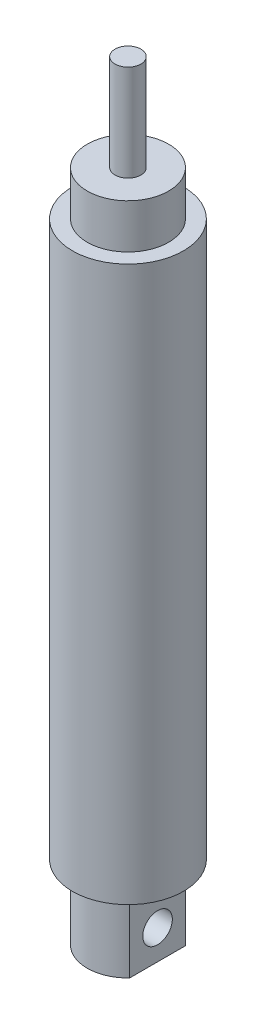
ISO-10303-21;
HEADER;
FILE_DESCRIPTION(('STEP AP214'),'2;1');
FILE_NAME('part.step','',(''),(''),'','','');
FILE_SCHEMA(('AUTOMOTIVE_DESIGN { 1 0 10303 214 1 1 1 1 }'));
ENDSEC;
DATA;
#1=APPLICATION_CONTEXT('core data for automotive mechanical design processes');
#2=APPLICATION_PROTOCOL_DEFINITION('international standard','automotive_design',2000,#1);
#3=PRODUCT_CONTEXT('',#1,'mechanical');
#4=PRODUCT('Part','Part','',(#3));
#5=PRODUCT_RELATED_PRODUCT_CATEGORY('part','',(#4));
#6=PRODUCT_DEFINITION_FORMATION('','',#4);
#7=PRODUCT_DEFINITION_CONTEXT('part definition',#1,'design');
#8=PRODUCT_DEFINITION('design','',#6,#7);
#9=PRODUCT_DEFINITION_SHAPE('','',#8);
#10=(LENGTH_UNIT() NAMED_UNIT(*) SI_UNIT(.MILLI.,.METRE.));
#11=(NAMED_UNIT(*) PLANE_ANGLE_UNIT() SI_UNIT($,.RADIAN.));
#12=(NAMED_UNIT(*) SI_UNIT($,.STERADIAN.) SOLID_ANGLE_UNIT());
#13=UNCERTAINTY_MEASURE_WITH_UNIT(LENGTH_MEASURE(1.E-05),#10,'distance_accuracy_value','');
#14=(GEOMETRIC_REPRESENTATION_CONTEXT(3) GLOBAL_UNCERTAINTY_ASSIGNED_CONTEXT((#13)) GLOBAL_UNIT_ASSIGNED_CONTEXT((#10,
#11,#12)) REPRESENTATION_CONTEXT('',''));
#15=CARTESIAN_POINT('',(0.,0.,0.));
#16=DIRECTION('',(0.,0.,1.));
#17=DIRECTION('',(1.,0.,0.));
#18=AXIS2_PLACEMENT_3D('',#15,#16,#17);
#19=CARTESIAN_POINT('',(0.,20.,0.));
#20=DIRECTION('',(0.,-1.,0.));
#21=DIRECTION('',(0.,0.,-1.));
#22=AXIS2_PLACEMENT_3D('',#19,#20,#21);
#23=CYLINDRICAL_SURFACE('',#22,11.);
#24=CARTESIAN_POINT('',(0.,0.,0.));
#25=DIRECTION('',(0.,1.,0.));
#26=DIRECTION('',(0.,0.,1.));
#27=AXIS2_PLACEMENT_3D('',#24,#25,#26);
#28=CIRCLE('',#27,11.);
#29=CARTESIAN_POINT('',(8.,0.,-7.54983443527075));
#30=VERTEX_POINT('',#29);
#31=CARTESIAN_POINT('',(-8.,0.,-7.54983443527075));
#32=VERTEX_POINT('',#31);
#33=EDGE_CURVE('E101',#30,#32,#28,.T.);
#34=ORIENTED_EDGE('',*,*,#33,.T.);
#35=DIRECTION('',(0.,-1.,0.));
#36=VECTOR('',#35,1.);
#37=CARTESIAN_POINT('',(-8.,20.,-7.54983443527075));
#38=LINE('',#37,#36);
#39=CARTESIAN_POINT('',(-8.,20.,-7.54983443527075));
#40=VERTEX_POINT('',#39);
#41=EDGE_CURVE('E36',#40,#32,#38,.T.);
#42=ORIENTED_EDGE('',*,*,#41,.F.);
#43=CARTESIAN_POINT('',(0.,20.,0.));
#44=DIRECTION('',(0.,1.,0.));
#45=DIRECTION('',(0.,0.,1.));
#46=AXIS2_PLACEMENT_3D('',#43,#44,#45);
#47=CIRCLE('',#46,11.);
#48=CARTESIAN_POINT('',(8.,20.,-7.54983443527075));
#49=VERTEX_POINT('',#48);
#50=EDGE_CURVE('E84',#49,#40,#47,.T.);
#51=ORIENTED_EDGE('',*,*,#50,.F.);
#52=DIRECTION('',(0.,-1.,0.));
#53=VECTOR('',#52,1.);
#54=CARTESIAN_POINT('',(8.,20.,-7.54983443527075));
#55=LINE('',#54,#53);
#56=EDGE_CURVE('E86',#49,#30,#55,.T.);
#57=ORIENTED_EDGE('',*,*,#56,.T.);
#58=EDGE_LOOP('',(#34,#42,#51,#57));
#59=FACE_BOUND('',#58,.T.);
#60=ADVANCED_FACE('F33',(#59),#23,.T.);
#61=CARTESIAN_POINT('',(-8.,20.,-7.54983443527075));
#62=DIRECTION('',(1.,0.,0.));
#63=DIRECTION('',(0.,0.,-1.));
#64=AXIS2_PLACEMENT_3D('',#61,#62,#63);
#65=PLANE('',#64);
#66=CARTESIAN_POINT('',(-8.,8.,0.));
#67=DIRECTION('',(1.,0.,0.));
#68=DIRECTION('',(0.,0.,-1.));
#69=AXIS2_PLACEMENT_3D('',#66,#67,#68);
#70=CIRCLE('',#69,4.);
#71=CARTESIAN_POINT('',(-8.,8.,-4.));
#72=VERTEX_POINT('',#71);
#73=EDGE_CURVE('E104',#72,#72,#70,.T.);
#74=ORIENTED_EDGE('',*,*,#73,.T.);
#75=EDGE_LOOP('',(#74));
#76=FACE_BOUND('',#75,.T.);
#77=DIRECTION('',(0.,0.,1.));
#78=VECTOR('',#77,1.);
#79=CARTESIAN_POINT('',(-8.,0.,-7.54983443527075));
#80=LINE('',#79,#78);
#81=CARTESIAN_POINT('',(-8.,0.,7.54983443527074));
#82=VERTEX_POINT('',#81);
#83=EDGE_CURVE('E103',#32,#82,#80,.T.);
#84=ORIENTED_EDGE('',*,*,#83,.T.);
#85=DIRECTION('',(0.,-1.,0.));
#86=VECTOR('',#85,1.);
#87=CARTESIAN_POINT('',(-8.,20.,7.54983443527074));
#88=LINE('',#87,#86);
#89=CARTESIAN_POINT('',(-8.,20.,7.54983443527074));
#90=VERTEX_POINT('',#89);
#91=EDGE_CURVE('E108',#90,#82,#88,.T.);
#92=ORIENTED_EDGE('',*,*,#91,.F.);
#93=DIRECTION('',(0.,0.,1.));
#94=VECTOR('',#93,1.);
#95=CARTESIAN_POINT('',(-8.,20.,-7.54983443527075));
#96=LINE('',#95,#94);
#97=EDGE_CURVE('E78',#40,#90,#96,.T.);
#98=ORIENTED_EDGE('',*,*,#97,.F.);
#99=ORIENTED_EDGE('',*,*,#41,.T.);
#100=EDGE_LOOP('',(#84,#92,#98,#99));
#101=FACE_BOUND('',#100,.T.);
#102=ADVANCED_FACE('F128',(#76,#101),#65,.F.);
#103=CARTESIAN_POINT('',(0.,20.,0.));
#104=DIRECTION('',(0.,-1.,0.));
#105=DIRECTION('',(0.,0.,-1.));
#106=AXIS2_PLACEMENT_3D('',#103,#104,#105);
#107=CYLINDRICAL_SURFACE('',#106,11.);
#108=CARTESIAN_POINT('',(0.,0.,0.));
#109=DIRECTION('',(0.,1.,0.));
#110=DIRECTION('',(0.,0.,1.));
#111=AXIS2_PLACEMENT_3D('',#108,#109,#110);
#112=CIRCLE('',#111,11.);
#113=CARTESIAN_POINT('',(8.,0.,7.54983443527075));
#114=VERTEX_POINT('',#113);
#115=EDGE_CURVE('E67',#82,#114,#112,.T.);
#116=ORIENTED_EDGE('',*,*,#115,.T.);
#117=DIRECTION('',(0.,-1.,0.));
#118=VECTOR('',#117,1.);
#119=CARTESIAN_POINT('',(8.,20.,7.54983443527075));
#120=LINE('',#119,#118);
#121=CARTESIAN_POINT('',(8.,20.,7.54983443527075));
#122=VERTEX_POINT('',#121);
#123=EDGE_CURVE('E51',#122,#114,#120,.T.);
#124=ORIENTED_EDGE('',*,*,#123,.F.);
#125=CARTESIAN_POINT('',(0.,20.,0.));
#126=DIRECTION('',(0.,1.,0.));
#127=DIRECTION('',(0.,0.,1.));
#128=AXIS2_PLACEMENT_3D('',#125,#126,#127);
#129=CIRCLE('',#128,11.);
#130=EDGE_CURVE('E96',#90,#122,#129,.T.);
#131=ORIENTED_EDGE('',*,*,#130,.F.);
#132=ORIENTED_EDGE('',*,*,#91,.T.);
#133=EDGE_LOOP('',(#116,#124,#131,#132));
#134=FACE_BOUND('',#133,.T.);
#135=ADVANCED_FACE('F149',(#134),#107,.T.);
#136=CARTESIAN_POINT('',(8.,20.,-7.54983443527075));
#137=DIRECTION('',(-1.,0.,0.));
#138=DIRECTION('',(0.,0.,1.));
#139=AXIS2_PLACEMENT_3D('',#136,#137,#138);
#140=PLANE('',#139);
#141=CARTESIAN_POINT('',(8.,8.,0.));
#142=DIRECTION('',(1.,0.,0.));
#143=DIRECTION('',(0.,0.,-1.));
#144=AXIS2_PLACEMENT_3D('',#141,#142,#143);
#145=CIRCLE('',#144,4.);
#146=CARTESIAN_POINT('',(8.,8.,-4.));
#147=VERTEX_POINT('',#146);
#148=EDGE_CURVE('E119',#147,#147,#145,.T.);
#149=ORIENTED_EDGE('',*,*,#148,.F.);
#150=EDGE_LOOP('',(#149));
#151=FACE_BOUND('',#150,.T.);
#152=DIRECTION('',(0.,0.,-1.));
#153=VECTOR('',#152,1.);
#154=CARTESIAN_POINT('',(8.,0.,-7.54983443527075));
#155=LINE('',#154,#153);
#156=EDGE_CURVE('E72',#114,#30,#155,.T.);
#157=ORIENTED_EDGE('',*,*,#156,.T.);
#158=ORIENTED_EDGE('',*,*,#56,.F.);
#159=DIRECTION('',(0.,0.,-1.));
#160=VECTOR('',#159,1.);
#161=CARTESIAN_POINT('',(8.,20.,-7.54983443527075));
#162=LINE('',#161,#160);
#163=EDGE_CURVE('E92',#122,#49,#162,.T.);
#164=ORIENTED_EDGE('',*,*,#163,.F.);
#165=ORIENTED_EDGE('',*,*,#123,.T.);
#166=EDGE_LOOP('',(#157,#158,#164,#165));
#167=FACE_BOUND('',#166,.T.);
#168=ADVANCED_FACE('F91',(#151,#167),#140,.F.);
#169=CARTESIAN_POINT('',(0.,0.,0.));
#170=DIRECTION('',(0.,1.,0.));
#171=DIRECTION('',(0.,0.,1.));
#172=AXIS2_PLACEMENT_3D('',#169,#170,#171);
#173=PLANE('',#172);
#174=ORIENTED_EDGE('',*,*,#33,.F.);
#175=ORIENTED_EDGE('',*,*,#156,.F.);
#176=ORIENTED_EDGE('',*,*,#115,.F.);
#177=ORIENTED_EDGE('',*,*,#83,.F.);
#178=EDGE_LOOP('',(#174,#175,#176,#177));
#179=FACE_BOUND('',#178,.T.);
#180=ADVANCED_FACE('F132',(#179),#173,.F.);
#181=CARTESIAN_POINT('',(-12.,8.,0.));
#182=DIRECTION('',(1.,0.,0.));
#183=DIRECTION('',(0.,0.,-1.));
#184=AXIS2_PLACEMENT_3D('',#181,#182,#183);
#185=CYLINDRICAL_SURFACE('',#184,4.);
#186=ORIENTED_EDGE('',*,*,#148,.T.);
#187=EDGE_LOOP('',(#186));
#188=FACE_BOUND('',#187,.T.);
#189=ORIENTED_EDGE('',*,*,#73,.F.);
#190=EDGE_LOOP('',(#189));
#191=FACE_BOUND('',#190,.T.);
#192=ADVANCED_FACE('F130',(#188,#191),#185,.F.);
#193=CARTESIAN_POINT('',(0.,20.,0.));
#194=DIRECTION('',(0.,1.,0.));
#195=DIRECTION('',(0.,0.,1.));
#196=AXIS2_PLACEMENT_3D('',#193,#194,#195);
#197=PLANE('',#196);
#198=CARTESIAN_POINT('',(0.,20.,0.));
#199=DIRECTION('',(0.,1.,0.));
#200=DIRECTION('',(0.,0.,1.));
#201=AXIS2_PLACEMENT_3D('',#198,#199,#200);
#202=CIRCLE('',#201,15.);
#203=CARTESIAN_POINT('',(0.,20.,15.));
#204=VERTEX_POINT('',#203);
#205=EDGE_CURVE('E120',#204,#204,#202,.T.);
#206=ORIENTED_EDGE('',*,*,#205,.F.);
#207=EDGE_LOOP('',(#206));
#208=FACE_BOUND('',#207,.T.);
#209=ORIENTED_EDGE('',*,*,#163,.T.);
#210=ORIENTED_EDGE('',*,*,#50,.T.);
#211=ORIENTED_EDGE('',*,*,#97,.T.);
#212=ORIENTED_EDGE('',*,*,#130,.T.);
#213=EDGE_LOOP('',(#209,#210,#211,#212));
#214=FACE_BOUND('',#213,.T.);
#215=ADVANCED_FACE('F95',(#208,#214),#197,.F.);
#216=CARTESIAN_POINT('',(0.,170.,0.));
#217=DIRECTION('',(0.,-1.,0.));
#218=DIRECTION('',(0.,0.,-1.));
#219=AXIS2_PLACEMENT_3D('',#216,#217,#218);
#220=CYLINDRICAL_SURFACE('',#219,15.);
#221=CARTESIAN_POINT('',(0.,170.,0.));
#222=DIRECTION('',(0.,1.,0.));
#223=DIRECTION('',(0.,0.,1.));
#224=AXIS2_PLACEMENT_3D('',#221,#222,#223);
#225=CIRCLE('',#224,15.);
#226=CARTESIAN_POINT('',(0.,170.,15.));
#227=VERTEX_POINT('',#226);
#228=EDGE_CURVE('E116',#227,#227,#225,.T.);
#229=ORIENTED_EDGE('',*,*,#228,.F.);
#230=EDGE_LOOP('',(#229));
#231=FACE_BOUND('',#230,.T.);
#232=ORIENTED_EDGE('',*,*,#205,.T.);
#233=EDGE_LOOP('',(#232));
#234=FACE_BOUND('',#233,.T.);
#235=ADVANCED_FACE('F139',(#231,#234),#220,.T.);
#236=CARTESIAN_POINT('',(0.,170.,0.));
#237=DIRECTION('',(0.,1.,0.));
#238=DIRECTION('',(0.,0.,1.));
#239=AXIS2_PLACEMENT_3D('',#236,#237,#238);
#240=PLANE('',#239);
#241=CARTESIAN_POINT('',(0.,170.,0.));
#242=DIRECTION('',(0.,1.,0.));
#243=DIRECTION('',(0.,0.,1.));
#244=AXIS2_PLACEMENT_3D('',#241,#242,#243);
#245=CIRCLE('',#244,11.);
#246=CARTESIAN_POINT('',(0.,170.,11.));
#247=VERTEX_POINT('',#246);
#248=EDGE_CURVE('E42',#247,#247,#245,.T.);
#249=ORIENTED_EDGE('',*,*,#248,.F.);
#250=EDGE_LOOP('',(#249));
#251=FACE_BOUND('',#250,.T.);
#252=ORIENTED_EDGE('',*,*,#228,.T.);
#253=EDGE_LOOP('',(#252));
#254=FACE_BOUND('',#253,.T.);
#255=ADVANCED_FACE('F199',(#251,#254),#240,.T.);
#256=CARTESIAN_POINT('',(0.,182.,0.));
#257=DIRECTION('',(0.,-1.,0.));
#258=DIRECTION('',(0.,0.,-1.));
#259=AXIS2_PLACEMENT_3D('',#256,#257,#258);
#260=CYLINDRICAL_SURFACE('',#259,11.);
#261=CARTESIAN_POINT('',(0.,182.,0.));
#262=DIRECTION('',(0.,1.,0.));
#263=DIRECTION('',(0.,0.,1.));
#264=AXIS2_PLACEMENT_3D('',#261,#262,#263);
#265=CIRCLE('',#264,11.);
#266=CARTESIAN_POINT('',(0.,182.,11.));
#267=VERTEX_POINT('',#266);
#268=EDGE_CURVE('E115',#267,#267,#265,.T.);
#269=ORIENTED_EDGE('',*,*,#268,.F.);
#270=EDGE_LOOP('',(#269));
#271=FACE_BOUND('',#270,.T.);
#272=ORIENTED_EDGE('',*,*,#248,.T.);
#273=EDGE_LOOP('',(#272));
#274=FACE_BOUND('',#273,.T.);
#275=ADVANCED_FACE('F207',(#271,#274),#260,.T.);
#276=CARTESIAN_POINT('',(0.,182.,0.));
#277=DIRECTION('',(0.,1.,0.));
#278=DIRECTION('',(0.,0.,1.));
#279=AXIS2_PLACEMENT_3D('',#276,#277,#278);
#280=PLANE('',#279);
#281=CARTESIAN_POINT('',(0.,182.,0.));
#282=DIRECTION('',(0.,1.,0.));
#283=DIRECTION('',(0.,0.,1.));
#284=AXIS2_PLACEMENT_3D('',#281,#282,#283);
#285=CIRCLE('',#284,3.5);
#286=CARTESIAN_POINT('',(0.,182.,-3.5));
#287=VERTEX_POINT('',#286);
#288=EDGE_CURVE('E11',#287,#287,#285,.T.);
#289=ORIENTED_EDGE('',*,*,#288,.F.);
#290=EDGE_LOOP('',(#289));
#291=FACE_BOUND('',#290,.T.);
#292=ORIENTED_EDGE('',*,*,#268,.T.);
#293=EDGE_LOOP('',(#292));
#294=FACE_BOUND('',#293,.T.);
#295=ADVANCED_FACE('F216',(#291,#294),#280,.T.);
#296=CARTESIAN_POINT('',(0.,208.,0.));
#297=DIRECTION('',(0.,-1.,0.));
#298=DIRECTION('',(0.,0.,-1.));
#299=AXIS2_PLACEMENT_3D('',#296,#297,#298);
#300=CYLINDRICAL_SURFACE('',#299,3.5);
#301=CARTESIAN_POINT('',(0.,208.,0.));
#302=DIRECTION('',(0.,1.,0.));
#303=DIRECTION('',(0.,0.,1.));
#304=AXIS2_PLACEMENT_3D('',#301,#302,#303);
#305=CIRCLE('',#304,3.5);
#306=CARTESIAN_POINT('',(0.,208.,-3.5));
#307=VERTEX_POINT('',#306);
#308=EDGE_CURVE('E254',#307,#307,#305,.T.);
#309=CARTESIAN_POINT('',(0.,208.,-3.5));
#310=CARTESIAN_POINT('',(0.,207.729166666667,-3.5));
#311=CARTESIAN_POINT('',(0.,207.458333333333,-3.5));
#312=CARTESIAN_POINT('',(0.,206.916666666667,-3.5));
#313=CARTESIAN_POINT('',(0.,206.645833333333,-3.5));
#314=CARTESIAN_POINT('',(0.,206.104166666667,-3.5));
#315=CARTESIAN_POINT('',(0.,205.833333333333,-3.5));
#316=CARTESIAN_POINT('',(0.,205.291666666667,-3.5));
#317=CARTESIAN_POINT('',(0.,205.020833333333,-3.5));
#318=CARTESIAN_POINT('',(0.,204.479166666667,-3.5));
#319=CARTESIAN_POINT('',(0.,204.208333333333,-3.5));
#320=CARTESIAN_POINT('',(0.,203.666666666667,-3.5));
#321=CARTESIAN_POINT('',(0.,203.395833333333,-3.5));
#322=CARTESIAN_POINT('',(0.,202.854166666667,-3.5));
#323=CARTESIAN_POINT('',(0.,202.583333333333,-3.5));
#324=CARTESIAN_POINT('',(0.,202.041666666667,-3.5));
#325=CARTESIAN_POINT('',(0.,201.770833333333,-3.5));
#326=CARTESIAN_POINT('',(0.,201.229166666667,-3.5));
#327=CARTESIAN_POINT('',(0.,200.958333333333,-3.5));
#328=CARTESIAN_POINT('',(0.,200.416666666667,-3.5));
#329=CARTESIAN_POINT('',(0.,200.145833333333,-3.5));
#330=CARTESIAN_POINT('',(0.,199.604166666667,-3.5));
#331=CARTESIAN_POINT('',(0.,199.333333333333,-3.5));
#332=CARTESIAN_POINT('',(0.,198.791666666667,-3.5));
#333=CARTESIAN_POINT('',(0.,198.520833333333,-3.5));
#334=CARTESIAN_POINT('',(0.,197.979166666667,-3.5));
#335=CARTESIAN_POINT('',(0.,197.708333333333,-3.5));
#336=CARTESIAN_POINT('',(0.,197.166666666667,-3.5));
#337=CARTESIAN_POINT('',(0.,196.895833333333,-3.5));
#338=CARTESIAN_POINT('',(0.,196.354166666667,-3.5));
#339=CARTESIAN_POINT('',(0.,196.083333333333,-3.5));
#340=CARTESIAN_POINT('',(0.,195.541666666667,-3.5));
#341=CARTESIAN_POINT('',(0.,195.270833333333,-3.5));
#342=CARTESIAN_POINT('',(0.,194.729166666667,-3.5));
#343=CARTESIAN_POINT('',(0.,194.458333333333,-3.5));
#344=CARTESIAN_POINT('',(0.,193.916666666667,-3.5));
#345=CARTESIAN_POINT('',(0.,193.645833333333,-3.5));
#346=CARTESIAN_POINT('',(0.,193.104166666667,-3.5));
#347=CARTESIAN_POINT('',(0.,192.833333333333,-3.5));
#348=CARTESIAN_POINT('',(0.,192.291666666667,-3.5));
#349=CARTESIAN_POINT('',(0.,192.020833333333,-3.5));
#350=CARTESIAN_POINT('',(0.,191.479166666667,-3.5));
#351=CARTESIAN_POINT('',(0.,191.208333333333,-3.5));
#352=CARTESIAN_POINT('',(0.,190.666666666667,-3.5));
#353=CARTESIAN_POINT('',(0.,190.395833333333,-3.5));
#354=CARTESIAN_POINT('',(0.,189.854166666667,-3.5));
#355=CARTESIAN_POINT('',(0.,189.583333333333,-3.5));
#356=CARTESIAN_POINT('',(0.,189.041666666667,-3.5));
#357=CARTESIAN_POINT('',(0.,188.770833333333,-3.5));
#358=CARTESIAN_POINT('',(0.,188.229166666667,-3.5));
#359=CARTESIAN_POINT('',(0.,187.958333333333,-3.5));
#360=CARTESIAN_POINT('',(0.,187.416666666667,-3.5));
#361=CARTESIAN_POINT('',(0.,187.145833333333,-3.5));
#362=CARTESIAN_POINT('',(0.,186.604166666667,-3.5));
#363=CARTESIAN_POINT('',(0.,186.333333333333,-3.5));
#364=CARTESIAN_POINT('',(0.,185.791666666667,-3.5));
#365=CARTESIAN_POINT('',(0.,185.520833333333,-3.5));
#366=CARTESIAN_POINT('',(0.,184.979166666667,-3.5));
#367=CARTESIAN_POINT('',(0.,184.708333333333,-3.5));
#368=CARTESIAN_POINT('',(0.,184.166666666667,-3.5));
#369=CARTESIAN_POINT('',(0.,183.895833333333,-3.5));
#370=CARTESIAN_POINT('',(0.,183.354166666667,-3.5));
#371=CARTESIAN_POINT('',(0.,183.083333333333,-3.5));
#372=CARTESIAN_POINT('',(0.,182.541666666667,-3.5));
#373=CARTESIAN_POINT('',(0.,182.270833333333,-3.5));
#374=CARTESIAN_POINT('',(0.,182.,-3.5));
#375=B_SPLINE_CURVE_WITH_KNOTS('',3,(#309,#310,#311,#312,#313,#314,#315,#316,#317,#318,#319,
#320,#321,#322,#323,#324,#325,#326,#327,#328,#329,#330,#331,#332,#333,#334,#335,#336,#337,#338,
#339,#340,#341,#342,#343,#344,#345,#346,#347,#348,#349,#350,#351,#352,#353,#354,#355,#356,#357,
#358,#359,#360,#361,#362,#363,#364,#365,#366,#367,#368,#369,#370,#371,#372,#373,#374),
.UNSPECIFIED.,.F.,.F.,(4,2,2,2,2,2,2,2,2,2,2,2,2,2,2,2,2,2,2,2,2,2,2,2,2,2,2,2,2,2,2,2,4),(0.,
0.812499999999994,1.62499999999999,2.43749999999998,3.24999999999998,4.0625,4.87499999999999,
5.68749999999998,6.49999999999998,7.3125,8.12499999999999,8.93749999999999,9.74999999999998,
10.5625,11.375,12.1875,13.,13.8125,14.625,15.4375,16.25,17.0625,17.875,18.6875,19.5,20.3125,
21.125,21.9375,22.75,23.5625,24.375,25.1875,26.),.UNSPECIFIED.);
#376=EDGE_CURVE('BSEAM225',#307,#287,#375,.T.);
#377=ORIENTED_EDGE('',*,*,#308,.F.);
#378=ORIENTED_EDGE('',*,*,#288,.T.);
#379=ORIENTED_EDGE('',*,*,#376,.T.);
#380=ORIENTED_EDGE('',*,*,#376,.F.);
#381=EDGE_LOOP('',(#377,#379,#378,#380));
#382=FACE_BOUND('',#381,.T.);
#383=ADVANCED_FACE('F225',(#382),#300,.T.);
#384=CARTESIAN_POINT('',(0.,208.,0.));
#385=DIRECTION('',(0.,1.,0.));
#386=DIRECTION('',(0.,0.,1.));
#387=AXIS2_PLACEMENT_3D('',#384,#385,#386);
#388=PLANE('',#387);
#389=ORIENTED_EDGE('',*,*,#308,.T.);
#390=EDGE_LOOP('',(#389));
#391=FACE_BOUND('',#390,.T.);
#392=ADVANCED_FACE('F234',(#391),#388,.T.);
#393=CLOSED_SHELL('',(#60,#102,#135,#168,#180,#192,#215,#235,#255,#275,#295,#383,#392));
#394=MANIFOLD_SOLID_BREP('B2',#393);
#395=ADVANCED_BREP_SHAPE_REPRESENTATION('',(#18,#394),#14);
#396=SHAPE_DEFINITION_REPRESENTATION(#9,#395);
ENDSEC;
END-ISO-10303-21;
